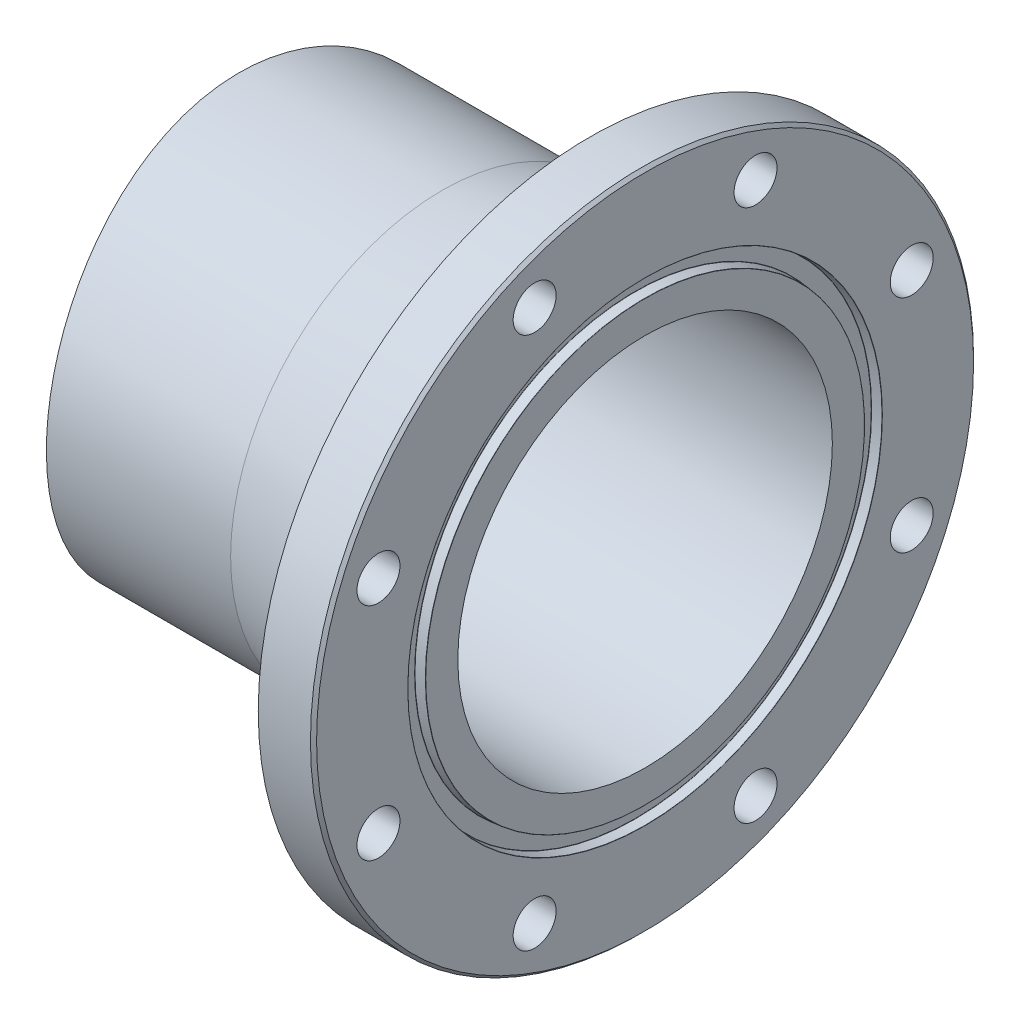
from build123d import *

# Parameters (mm, degrees)
SKETCH2_R          = 609.6
CUT_EXTRUDE1_DEPTH = 139.7
CIRPATTERN1_COUNT  = 8
FILLET1_R          = 9.525
CHAMFER1_SIZE      = 1.5875


with BuildPart() as part:
    # Sketch1 → Revolve1 (revolve)
    with BuildSketch(Plane(origin=(0, 0, 0), x_dir=(1, 0, 0), z_dir=(0, 1, 0)), mode=Mode.PRIVATE) as revolve1_sk:
        with BuildLine():
            Line((0, 96.8375), (219.075, 96.8375))
            Line((219.075, 96.8375), (219.075, 113.419461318))
            ThreePointArc((219.075, 113.419461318), (219.041634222, 113.505261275), (218.959068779, 113.545978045))
            Line((218.959068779, 113.545978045), (214.085531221, 113.972357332))
            ThreePointArc((214.085531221, 113.972357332), (214.002965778, 114.013074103), (213.9696, 114.098874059))
            Line((213.9696, 114.098874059), (213.9696, 122.044925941))
            ThreePointArc((213.9696, 122.044925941), (214.002965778, 122.130725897), (214.085531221, 122.171442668))
            Line((214.085531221, 122.171442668), (218.959068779, 122.597821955))
            ThreePointArc((218.959068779, 122.597821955), (219.041634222, 122.638538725), (219.075, 122.724338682))
            Line((219.075, 122.724338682), (219.075, 171.45))
            Line((219.075, 171.45), (190.5, 171.45))
            Line((190.5, 171.45), (190.5, 123.825))
            Line((190.5, 123.825), (114.3, 109.5375))
            Line((114.3, 109.5375), (0, 109.5375))
            Line((0, 109.5375), (0, 96.8375))
        make_face()
    revolve(revolve1_sk.sketch.rotate(Axis((0, 0, 0), (1, 0, 0)), 180), axis=Axis((0, 0, 0), (1, 0, 0)))

    # Sketch2 → Cut-Extrude1 (cut, symmetric)
    with BuildSketch(Plane.XY):
        with Locations((-590.55, 0)):
            Circle(SKETCH2_R)
    extrude(amount=CUT_EXTRUDE1_DEPTH, both=True, mode=Mode.SUBTRACT)

    # Sketch4 → 7_8 _0.875_ Diameter Hole1 (revolve, cut)
    with BuildSketch(Plane(origin=(219.075, 57.105935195, 137.865923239), x_dir=(0, 0, -1), z_dir=(0, 1, 0))):
        Polygon((0, 0), (0, 82.877063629), (11.1125, 76.2), (11.1125, 0), align=None)
    f_7_8_0_875_diameter_hole1 = revolve(axis=Axis((225.425, 57.105935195, 137.865923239), (-1, 0, 0)), mode=Mode.SUBTRACT)

    # CirPattern1: 7_8 _0.875_ Diameter Hole1 ×8 about axis
    cirpattern1_axis = Axis((0, 0, 0), (1, 0, 0))
    for i in range(1, CIRPATTERN1_COUNT):
        add(f_7_8_0_875_diameter_hole1.rotate(cirpattern1_axis, i * 360 / CIRPATTERN1_COUNT), mode=Mode.SUBTRACT)

    # Fillet1
    fillet1_edges = [part.edges().sort_by_distance(p)[0] for p in [
        (190.5, 0, -123.825),
    ]]
    fillet(fillet1_edges, radius=FILLET1_R)

    # Chamfer1
    chamfer1_edges = [part.edges().sort_by_distance(p)[0] for p in [
        (219.075, 0, -171.45),
    ]]
    chamfer(chamfer1_edges, length=CHAMFER1_SIZE)


solid = part.part
